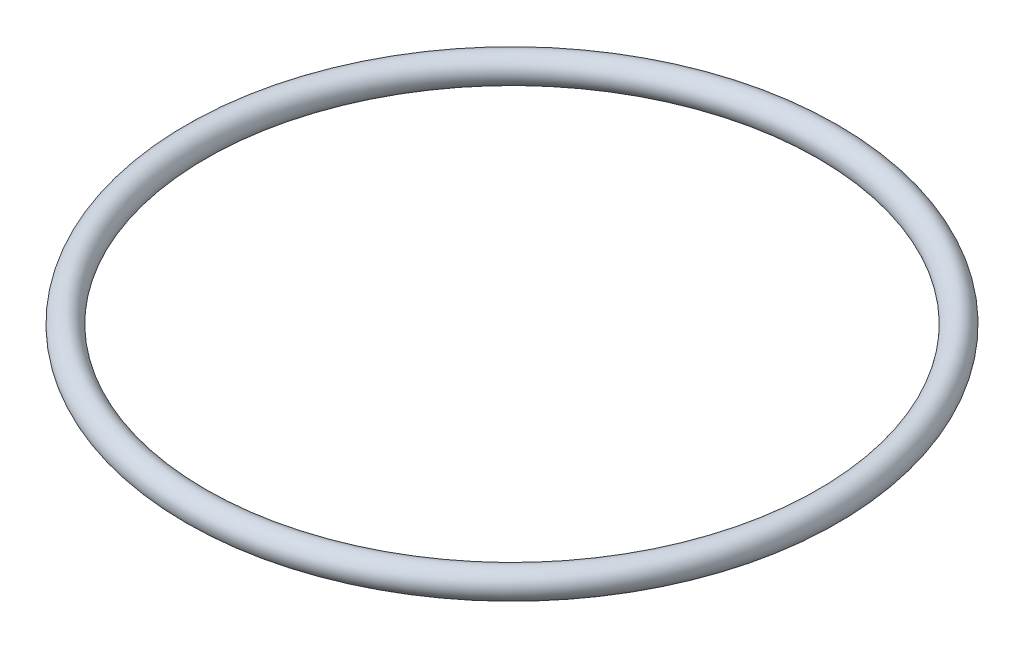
from build123d import *

# Parameters (mm, degrees)
ESQUISSE1_R = 1.5


with BuildPart() as part:
    # Esquisse1 → Base-R_volution (revolve)
    with BuildSketch(Plane.XY, mode=Mode.PRIVATE) as base_r_volution_sk:
        with Locations((34.5, 0)):
            Circle(ESQUISSE1_R)
    revolve(base_r_volution_sk.sketch.rotate(Axis((0, 18.852901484, 0), (0, -1, 0)), 90), axis=Axis((0, 18.852901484, 0), (0, -1, 0)))


solid = part.part
